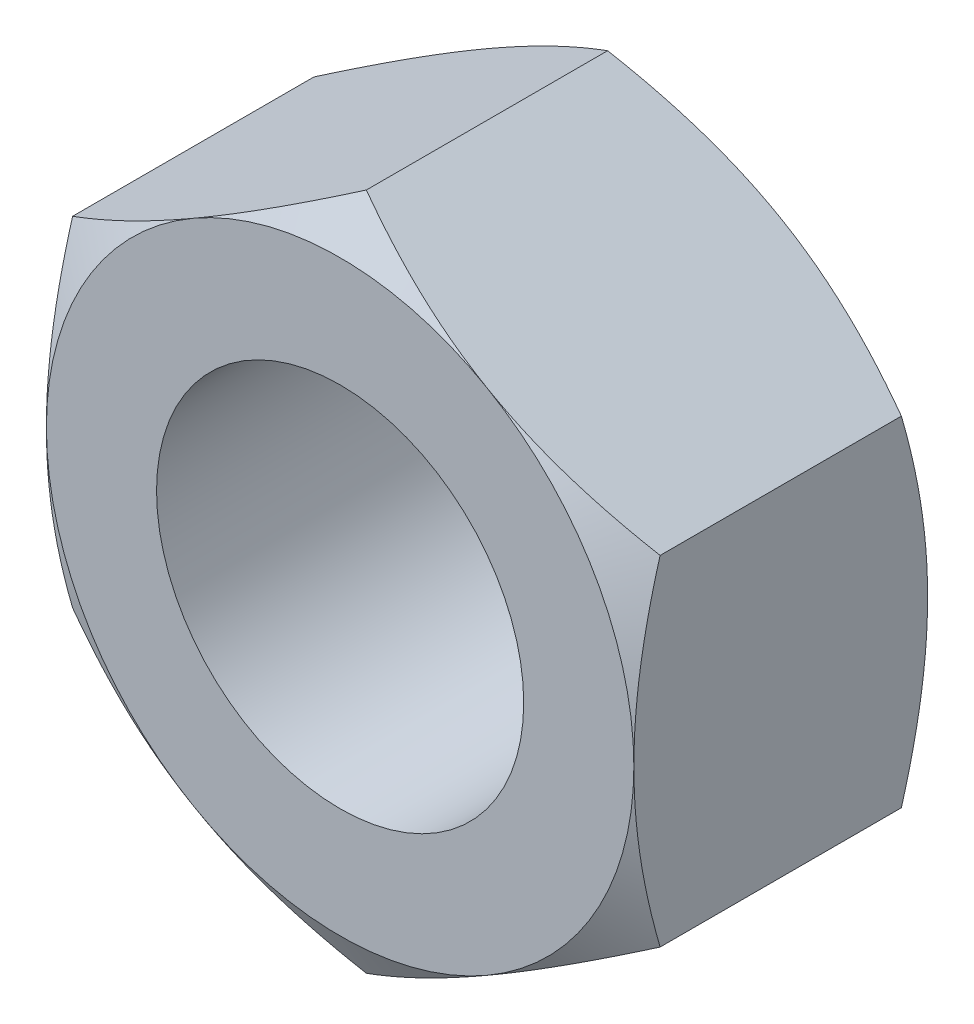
from build123d import *

# Parameters (mm, degrees)
BASE_EXTRUSION_DEPTH    = 8
ESQUISSE3_R             = 5
ENL_V_MAT_EXTRU_1_DEPTH = 15.605934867


with BuildPart() as part:
    # Esquisse1 → Base-Extrusion (new body)
    with BuildSketch(Plane.XY):
        Polygon((8, -4.618802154), (8, 4.618802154), (0, 9.237604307), (-8, 4.618802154), (-8, -4.618802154), (0, -9.237604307), align=None)
    extrude(amount=-BASE_EXTRUSION_DEPTH)

    # Esquisse2 → Enl_vement de mati_re-R_volution1 (revolve, cut)
    with BuildSketch(Plane(origin=(0, 0, 0), x_dir=(1, 0, 0), z_dir=(0, 1, 0)), mode=Mode.PRIVATE) as enl_vement_de_mati_re_r_volution1_sk:
        Polygon((-8, 0), (-15.92820323, 0), (-15.92820323, 8), (-8, 8), (-14.92820323, 4), align=None)
    revolve(enl_vement_de_mati_re_r_volution1_sk.sketch.rotate(Axis((0, 0, -8), (0, 0, 1)), 180), axis=Axis((0, 0, -8), (0, 0, 1)), mode=Mode.SUBTRACT)

    # Esquisse3 → Enl_v. mat.-Extru.1 (cut, through all)
    with BuildSketch(Plane.XY):
        Circle(ESQUISSE3_R)
    extrude(amount=-ENL_V_MAT_EXTRU_1_DEPTH, mode=Mode.SUBTRACT)


solid = part.part
